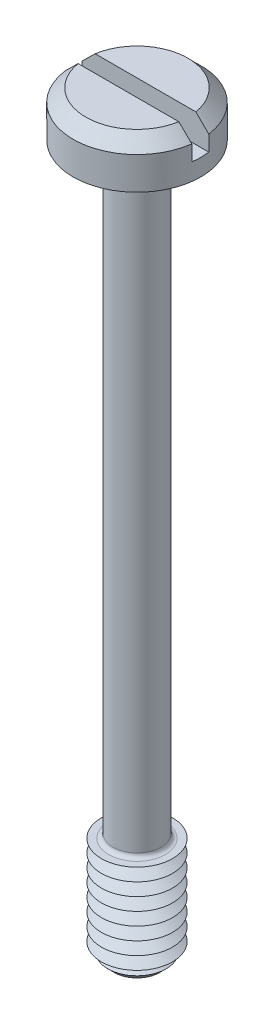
from build123d import *

# Parameters (mm, degrees)
SKETCH1_R           = 2.25
BOSS_EXTRUDE1_DEPTH = 1.6
SKETCH2_R           = 0.85
BOSS_EXTRUDE2_DEPTH = 25
SKETCH3_R           = 1.25
BOSS_EXTRUDE3_DEPTH = 3.7
CHAMFER1_SIZE       = 0.45
LPATTERN1_COUNT     = 8
LPATTERN1_PITCH     = 0.45
FILLET1_R           = 0.15
CHAMFER2_SIZE       = 0.45
SKETCH6_W           = 4.5
SKETCH6_H           = 0.6
CUT_EXTRUDE1_DEPTH  = 1


with BuildPart() as part:
    # Sketch1 → Boss-Extrude1 (new body)
    with BuildSketch(Plane(origin=(0, 0, 0), x_dir=(1, 0, 0), z_dir=(0, 1, 0))):
        with Locations(Location((0, 0, 0), (0, 0, 270))):
            Circle(SKETCH1_R)
    extrude(amount=BOSS_EXTRUDE1_DEPTH)

    # Sketch2 → Boss-Extrude2 (add)
    with BuildSketch(Plane.XZ):
        with Locations(Location((0, 0, 0), (0, 0, 270))):
            Circle(SKETCH2_R)
    extrude(amount=BOSS_EXTRUDE2_DEPTH)

    # Sketch3 → Boss-Extrude3 (add)
    with BuildSketch(Plane.XZ.offset(25)):
        with Locations(Location((0, 0, 0), (0, 0, 270))):
            Circle(SKETCH3_R)
    extrude(amount=-BOSS_EXTRUDE3_DEPTH)

    # Chamfer1
    chamfer1_edges = [part.edges().sort_by_distance(p)[0] for p in [
        (0, -25, 1.25),
    ]]
    chamfer(chamfer1_edges, length=CHAMFER1_SIZE)

    # Sketch5 → Cut-Revolve1 (revolve, cut)
    with BuildSketch(Plane(origin=(0, 0, 0), x_dir=(0, 0, -1), z_dir=(1, 0, 0))):
        Polygon((-1.25, -21.3), (-0.860288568, -21.525), (-1.25, -21.75), align=None)
    cut_revolve1 = revolve(axis=Axis((0, -6.58711856, 0), (0, -1, 0)), mode=Mode.SUBTRACT)

    # LPattern1: Cut-Revolve1 ×8
    with Locations(*[(0, -i * LPATTERN1_PITCH, 0) for i in range(1, LPATTERN1_COUNT)]):
        add(cut_revolve1, mode=Mode.SUBTRACT)

    # Fillet1
    fillet1_edges = [part.edges().sort_by_distance(p)[0] for p in [
        (0, 0, 0.85),
        (0, -21.3, 0.85),
    ]]
    fillet(fillet1_edges, radius=FILLET1_R)

    # Chamfer2
    chamfer2_edges = [part.edges().sort_by_distance(p)[0] for p in [
        (0, 1.6, -2.25),
    ]]
    chamfer(chamfer2_edges, length=CHAMFER2_SIZE)

    # Sketch6 → Cut-Extrude1 (cut)
    with BuildSketch(Plane(origin=(0, 1.6, 0), x_dir=(1, 0, 0), z_dir=(0, 1, 0))):
        Rectangle(SKETCH6_W, SKETCH6_H)
    extrude(amount=-CUT_EXTRUDE1_DEPTH, mode=Mode.SUBTRACT)


solid = part.part
